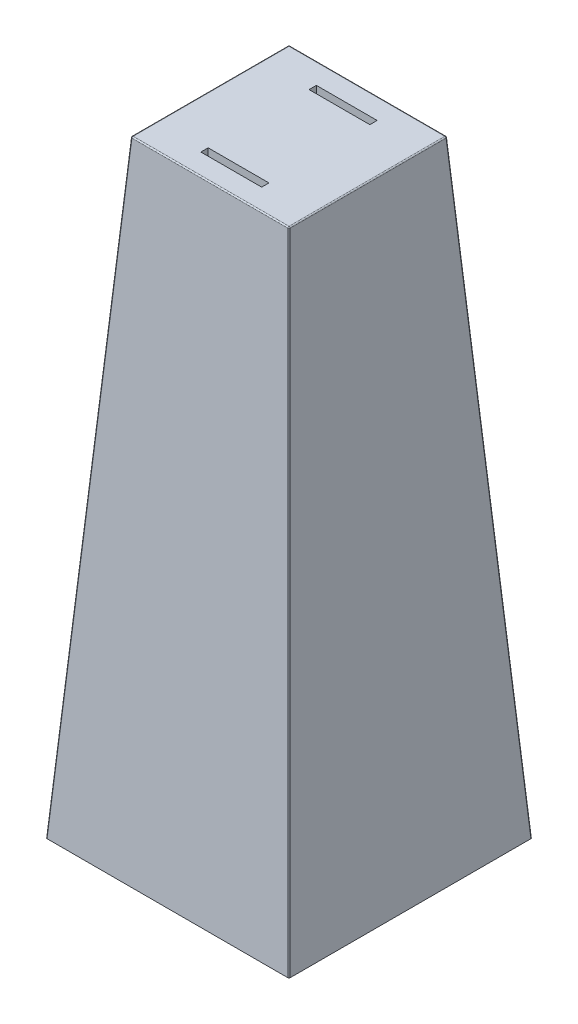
ISO-10303-21;
HEADER;
FILE_DESCRIPTION(('STEP AP214'),'2;1');
FILE_NAME('part.step','',(''),(''),'','','');
FILE_SCHEMA(('AUTOMOTIVE_DESIGN { 1 0 10303 214 1 1 1 1 }'));
ENDSEC;
DATA;
#1=APPLICATION_CONTEXT('core data for automotive mechanical design processes');
#2=APPLICATION_PROTOCOL_DEFINITION('international standard','automotive_design',2000,#1);
#3=PRODUCT_CONTEXT('',#1,'mechanical');
#4=PRODUCT('Part','Part','',(#3));
#5=PRODUCT_RELATED_PRODUCT_CATEGORY('part','',(#4));
#6=PRODUCT_DEFINITION_FORMATION('','',#4);
#7=PRODUCT_DEFINITION_CONTEXT('part definition',#1,'design');
#8=PRODUCT_DEFINITION('design','',#6,#7);
#9=PRODUCT_DEFINITION_SHAPE('','',#8);
#10=(LENGTH_UNIT() NAMED_UNIT(*) SI_UNIT(.MILLI.,.METRE.));
#11=(NAMED_UNIT(*) PLANE_ANGLE_UNIT() SI_UNIT($,.RADIAN.));
#12=(NAMED_UNIT(*) SI_UNIT($,.STERADIAN.) SOLID_ANGLE_UNIT());
#13=UNCERTAINTY_MEASURE_WITH_UNIT(LENGTH_MEASURE(1.E-05),#10,'distance_accuracy_value','');
#14=(GEOMETRIC_REPRESENTATION_CONTEXT(3) GLOBAL_UNCERTAINTY_ASSIGNED_CONTEXT((#13)) GLOBAL_UNIT_ASSIGNED_CONTEXT((#10,
#11,#12)) REPRESENTATION_CONTEXT('',''));
#15=CARTESIAN_POINT('',(0.,0.,0.));
#16=DIRECTION('',(0.,0.,1.));
#17=DIRECTION('',(1.,0.,0.));
#18=AXIS2_PLACEMENT_3D('',#15,#16,#17);
#19=CARTESIAN_POINT('',(65.,0.,-65.));
#20=DIRECTION('',(0.,1.,0.));
#21=DIRECTION('',(0.,0.,1.));
#22=AXIS2_PLACEMENT_3D('',#19,#20,#21);
#23=PLANE('',#22);
#24=DIRECTION('',(0.,0.,-1.));
#25=VECTOR('',#24,1.);
#26=CARTESIAN_POINT('',(-25.,0.,-47.5));
#27=LINE('',#26,#25);
#28=CARTESIAN_POINT('',(-25.,0.,-41.5));
#29=VERTEX_POINT('',#28);
#30=CARTESIAN_POINT('',(-25.,0.,-47.5));
#31=VERTEX_POINT('',#30);
#32=EDGE_CURVE('E195',#29,#31,#27,.T.);
#33=ORIENTED_EDGE('',*,*,#32,.T.);
#34=DIRECTION('',(1.,0.,0.));
#35=VECTOR('',#34,1.);
#36=CARTESIAN_POINT('',(-25.,0.,-47.5));
#37=LINE('',#36,#35);
#38=CARTESIAN_POINT('',(25.,0.,-47.5));
#39=VERTEX_POINT('',#38);
#40=EDGE_CURVE('E49',#31,#39,#37,.T.);
#41=ORIENTED_EDGE('',*,*,#40,.T.);
#42=DIRECTION('',(0.,0.,1.));
#43=VECTOR('',#42,1.);
#44=CARTESIAN_POINT('',(25.,0.,-47.5));
#45=LINE('',#44,#43);
#46=CARTESIAN_POINT('',(25.,0.,-41.5));
#47=VERTEX_POINT('',#46);
#48=EDGE_CURVE('E189',#39,#47,#45,.T.);
#49=ORIENTED_EDGE('',*,*,#48,.T.);
#50=DIRECTION('',(-1.,0.,0.));
#51=VECTOR('',#50,1.);
#52=CARTESIAN_POINT('',(-25.,0.,-41.5));
#53=LINE('',#52,#51);
#54=EDGE_CURVE('E192',#47,#29,#53,.T.);
#55=ORIENTED_EDGE('',*,*,#54,.T.);
#56=EDGE_LOOP('',(#33,#41,#49,#55));
#57=FACE_BOUND('',#56,.T.);
#58=DIRECTION('',(0.,0.,1.));
#59=VECTOR('',#58,1.);
#60=CARTESIAN_POINT('',(-64.0674849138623,0.,65.0000000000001));
#61=LINE('',#60,#59);
#62=CARTESIAN_POINT('',(-64.0674849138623,0.,-64.0674849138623));
#63=VERTEX_POINT('',#62);
#64=CARTESIAN_POINT('',(-64.0674849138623,0.,64.0674849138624));
#65=VERTEX_POINT('',#64);
#66=EDGE_CURVE('E268',#63,#65,#61,.T.);
#67=ORIENTED_EDGE('',*,*,#66,.T.);
#68=DIRECTION('',(1.,0.,0.));
#69=VECTOR('',#68,1.);
#70=CARTESIAN_POINT('',(65.,0.,64.0674849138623));
#71=LINE('',#70,#69);
#72=CARTESIAN_POINT('',(64.0674849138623,0.,64.0674849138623));
#73=VERTEX_POINT('',#72);
#74=EDGE_CURVE('E274',#65,#73,#71,.T.);
#75=ORIENTED_EDGE('',*,*,#74,.T.);
#76=DIRECTION('',(0.,0.,-1.));
#77=VECTOR('',#76,1.);
#78=CARTESIAN_POINT('',(64.0674849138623,0.,-65.));
#79=LINE('',#78,#77);
#80=CARTESIAN_POINT('',(64.0674849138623,0.,-64.0674849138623));
#81=VERTEX_POINT('',#80);
#82=EDGE_CURVE('E272',#73,#81,#79,.T.);
#83=ORIENTED_EDGE('',*,*,#82,.T.);
#84=DIRECTION('',(-1.,0.,0.));
#85=VECTOR('',#84,1.);
#86=CARTESIAN_POINT('',(-65.,0.,-64.0674849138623));
#87=LINE('',#86,#85);
#88=EDGE_CURVE('E270',#81,#63,#87,.T.);
#89=ORIENTED_EDGE('',*,*,#88,.T.);
#90=EDGE_LOOP('',(#67,#75,#83,#89));
#91=FACE_BOUND('',#90,.T.);
#92=DIRECTION('',(-1.,0.,0.));
#93=VECTOR('',#92,1.);
#94=CARTESIAN_POINT('',(-25.,0.,47.5));
#95=LINE('',#94,#93);
#96=CARTESIAN_POINT('',(25.,0.,47.5));
#97=VERTEX_POINT('',#96);
#98=CARTESIAN_POINT('',(-25.,0.,47.5));
#99=VERTEX_POINT('',#98);
#100=EDGE_CURVE('E171',#97,#99,#95,.T.);
#101=ORIENTED_EDGE('',*,*,#100,.T.);
#102=DIRECTION('',(0.,0.,-1.));
#103=VECTOR('',#102,1.);
#104=CARTESIAN_POINT('',(-25.,0.,41.5));
#105=LINE('',#104,#103);
#106=CARTESIAN_POINT('',(-25.,0.,41.5));
#107=VERTEX_POINT('',#106);
#108=EDGE_CURVE('E41',#99,#107,#105,.T.);
#109=ORIENTED_EDGE('',*,*,#108,.T.);
#110=DIRECTION('',(1.,0.,0.));
#111=VECTOR('',#110,1.);
#112=CARTESIAN_POINT('',(-25.,0.,41.5));
#113=LINE('',#112,#111);
#114=CARTESIAN_POINT('',(25.,0.,41.5));
#115=VERTEX_POINT('',#114);
#116=EDGE_CURVE('E154',#107,#115,#113,.T.);
#117=ORIENTED_EDGE('',*,*,#116,.T.);
#118=DIRECTION('',(0.,0.,1.));
#119=VECTOR('',#118,1.);
#120=CARTESIAN_POINT('',(25.,0.,41.5));
#121=LINE('',#120,#119);
#122=EDGE_CURVE('E162',#115,#97,#121,.T.);
#123=ORIENTED_EDGE('',*,*,#122,.T.);
#124=EDGE_LOOP('',(#101,#109,#117,#123));
#125=FACE_BOUND('',#124,.T.);
#126=ADVANCED_FACE('F26',(#57,#91,#125),#23,.T.);
#127=CARTESIAN_POINT('',(65.,0.,64.9999999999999));
#128=DIRECTION('',(0.997564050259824,0.0697564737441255,0.));
#129=DIRECTION('',(-0.0697564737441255,0.997564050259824,0.));
#130=AXIS2_PLACEMENT_3D('',#127,#128,#129);
#131=PLANE('',#130);
#132=DIRECTION('',(0.,0.,1.));
#133=VECTOR('',#132,1.);
#134=CARTESIAN_POINT('',(65.0650489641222,-0.930243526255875,64.9999999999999));
#135=LINE('',#134,#133);
#136=CARTESIAN_POINT('',(65.0650489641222,-0.930243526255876,-64.0674849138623));
#137=VERTEX_POINT('',#136);
#138=CARTESIAN_POINT('',(65.0650489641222,-0.930243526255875,64.0674849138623));
#139=VERTEX_POINT('',#138);
#140=EDGE_CURVE('E279',#137,#139,#135,.T.);
#141=ORIENTED_EDGE('',*,*,#140,.T.);
#142=DIRECTION('',(0.0695873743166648,-0.995145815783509,0.0695873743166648));
#143=VECTOR('',#142,1.);
#144=CARTESIAN_POINT('',(65.0048306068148,-0.0690808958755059,64.0072665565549));
#145=LINE('',#144,#143);
#146=CARTESIAN_POINT('',(99.9634059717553,-500.,98.9658419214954));
#147=VERTEX_POINT('',#146);
#148=EDGE_CURVE('E281',#139,#147,#145,.T.);
#149=ORIENTED_EDGE('',*,*,#148,.T.);
#150=DIRECTION('',(0.,0.,-1.));
#151=VECTOR('',#150,1.);
#152=CARTESIAN_POINT('',(99.9634059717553,-500.,-65.));
#153=LINE('',#152,#151);
#154=CARTESIAN_POINT('',(99.9634059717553,-500.,-98.9658419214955));
#155=VERTEX_POINT('',#154);
#156=EDGE_CURVE('E249',#155,#147,#153,.F.);
#157=ORIENTED_EDGE('',*,*,#156,.F.);
#158=DIRECTION('',(0.0695873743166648,-0.995145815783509,-0.0695873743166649));
#159=VECTOR('',#158,1.);
#160=CARTESIAN_POINT('',(64.3753182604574,8.93336507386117,-63.3777542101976));
#161=LINE('',#160,#159);
#162=EDGE_CURVE('E277',#155,#137,#161,.F.);
#163=ORIENTED_EDGE('',*,*,#162,.T.);
#164=EDGE_LOOP('',(#141,#149,#157,#163));
#165=FACE_BOUND('',#164,.T.);
#166=ADVANCED_FACE('F308',(#165),#131,.T.);
#167=CARTESIAN_POINT('',(65.,0.,64.9999999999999));
#168=DIRECTION('',(0.,0.0697564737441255,0.997564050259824));
#169=DIRECTION('',(0.,-0.997564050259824,0.0697564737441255));
#170=AXIS2_PLACEMENT_3D('',#167,#168,#169);
#171=PLANE('',#170);
#172=DIRECTION('',(1.,0.,0.));
#173=VECTOR('',#172,1.);
#174=CARTESIAN_POINT('',(65.0000000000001,-500.,99.9634059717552));
#175=LINE('',#174,#173);
#176=CARTESIAN_POINT('',(98.9658419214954,-500.,99.9634059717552));
#177=VERTEX_POINT('',#176);
#178=CARTESIAN_POINT('',(-98.9658419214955,-500.,99.9634059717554));
#179=VERTEX_POINT('',#178);
#180=EDGE_CURVE('E252',#177,#179,#175,.F.);
#181=ORIENTED_EDGE('',*,*,#180,.F.);
#182=DIRECTION('',(0.0695873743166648,-0.995145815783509,0.0695873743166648));
#183=VECTOR('',#182,1.);
#184=CARTESIAN_POINT('',(64.0072665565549,-0.0690808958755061,65.0048306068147));
#185=LINE('',#184,#183);
#186=CARTESIAN_POINT('',(64.0674849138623,-0.930243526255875,65.0650489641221));
#187=VERTEX_POINT('',#186);
#188=EDGE_CURVE('E266',#177,#187,#185,.F.);
#189=ORIENTED_EDGE('',*,*,#188,.T.);
#190=DIRECTION('',(-1.,0.,0.));
#191=VECTOR('',#190,1.);
#192=CARTESIAN_POINT('',(-65.,-0.930243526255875,65.0650489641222));
#193=LINE('',#192,#191);
#194=CARTESIAN_POINT('',(-64.0674849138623,-0.930243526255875,65.0650489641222));
#195=VERTEX_POINT('',#194);
#196=EDGE_CURVE('E263',#187,#195,#193,.T.);
#197=ORIENTED_EDGE('',*,*,#196,.T.);
#198=DIRECTION('',(-0.0695873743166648,-0.995145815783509,0.0695873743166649));
#199=VECTOR('',#198,1.);
#200=CARTESIAN_POINT('',(-63.3777542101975,8.93336507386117,64.3753182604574));
#201=LINE('',#200,#199);
#202=EDGE_CURVE('E261',#195,#179,#201,.T.);
#203=ORIENTED_EDGE('',*,*,#202,.T.);
#204=EDGE_LOOP('',(#181,#189,#197,#203));
#205=FACE_BOUND('',#204,.T.);
#206=ADVANCED_FACE('F28',(#205),#171,.T.);
#207=CARTESIAN_POINT('',(-65.,0.,65.0000000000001));
#208=DIRECTION('',(-0.997564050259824,0.0697564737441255,0.));
#209=DIRECTION('',(-0.0697564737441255,-0.997564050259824,0.));
#210=AXIS2_PLACEMENT_3D('',#207,#208,#209);
#211=PLANE('',#210);
#212=DIRECTION('',(0.,0.,-1.));
#213=VECTOR('',#212,1.);
#214=CARTESIAN_POINT('',(-65.0650489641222,-0.930243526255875,-64.9999999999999));
#215=LINE('',#214,#213);
#216=CARTESIAN_POINT('',(-65.0650489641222,-0.930243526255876,64.0674849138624));
#217=VERTEX_POINT('',#216);
#218=CARTESIAN_POINT('',(-65.0650489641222,-0.930243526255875,-64.0674849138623));
#219=VERTEX_POINT('',#218);
#220=EDGE_CURVE('E291',#217,#219,#215,.T.);
#221=ORIENTED_EDGE('',*,*,#220,.T.);
#222=DIRECTION('',(-0.0695873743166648,-0.995145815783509,-0.0695873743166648));
#223=VECTOR('',#222,1.);
#224=CARTESIAN_POINT('',(-64.3753182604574,8.93336507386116,-63.3777542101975));
#225=LINE('',#224,#223);
#226=CARTESIAN_POINT('',(-99.9634059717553,-500.,-98.9658419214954));
#227=VERTEX_POINT('',#226);
#228=EDGE_CURVE('E293',#219,#227,#225,.T.);
#229=ORIENTED_EDGE('',*,*,#228,.T.);
#230=DIRECTION('',(0.,0.,1.));
#231=VECTOR('',#230,1.);
#232=CARTESIAN_POINT('',(-99.9634059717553,-500.,-65.));
#233=LINE('',#232,#231);
#234=CARTESIAN_POINT('',(-99.9634059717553,-500.,98.9658419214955));
#235=VERTEX_POINT('',#234);
#236=EDGE_CURVE('E255',#235,#227,#233,.F.);
#237=ORIENTED_EDGE('',*,*,#236,.F.);
#238=DIRECTION('',(-0.0695873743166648,-0.995145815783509,0.0695873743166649));
#239=VECTOR('',#238,1.);
#240=CARTESIAN_POINT('',(-65.0048306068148,-0.0690808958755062,64.007266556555));
#241=LINE('',#240,#239);
#242=EDGE_CURVE('E289',#235,#217,#241,.F.);
#243=ORIENTED_EDGE('',*,*,#242,.T.);
#244=EDGE_LOOP('',(#221,#229,#237,#243));
#245=FACE_BOUND('',#244,.T.);
#246=ADVANCED_FACE('F338',(#245),#211,.T.);
#247=CARTESIAN_POINT('',(65.,0.,-65.));
#248=DIRECTION('',(0.,0.0697564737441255,-0.997564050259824));
#249=DIRECTION('',(0.,0.997564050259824,0.0697564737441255));
#250=AXIS2_PLACEMENT_3D('',#247,#248,#249);
#251=PLANE('',#250);
#252=DIRECTION('',(1.,0.,0.));
#253=VECTOR('',#252,1.);
#254=CARTESIAN_POINT('',(65.,-0.930243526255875,-65.0650489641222));
#255=LINE('',#254,#253);
#256=CARTESIAN_POINT('',(-64.0674849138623,-0.930243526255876,-65.0650489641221));
#257=VERTEX_POINT('',#256);
#258=CARTESIAN_POINT('',(64.0674849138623,-0.930243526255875,-65.0650489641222));
#259=VERTEX_POINT('',#258);
#260=EDGE_CURVE('E285',#257,#259,#255,.T.);
#261=ORIENTED_EDGE('',*,*,#260,.T.);
#262=DIRECTION('',(0.0695873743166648,-0.995145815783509,-0.0695873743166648));
#263=VECTOR('',#262,1.);
#264=CARTESIAN_POINT('',(64.007266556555,-0.0690808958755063,-65.0048306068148));
#265=LINE('',#264,#263);
#266=CARTESIAN_POINT('',(98.9658419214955,-500.,-99.9634059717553));
#267=VERTEX_POINT('',#266);
#268=EDGE_CURVE('E287',#259,#267,#265,.T.);
#269=ORIENTED_EDGE('',*,*,#268,.T.);
#270=DIRECTION('',(-1.,0.,0.));
#271=VECTOR('',#270,1.);
#272=CARTESIAN_POINT('',(65.,-500.,-99.9634059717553));
#273=LINE('',#272,#271);
#274=CARTESIAN_POINT('',(-98.9658419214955,-500.,-99.9634059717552));
#275=VERTEX_POINT('',#274);
#276=EDGE_CURVE('E258',#275,#267,#273,.F.);
#277=ORIENTED_EDGE('',*,*,#276,.F.);
#278=DIRECTION('',(-0.0695873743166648,-0.995145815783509,-0.0695873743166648));
#279=VECTOR('',#278,1.);
#280=CARTESIAN_POINT('',(-63.3777542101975,8.93336507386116,-64.3753182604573));
#281=LINE('',#280,#279);
#282=EDGE_CURVE('E283',#275,#257,#281,.F.);
#283=ORIENTED_EDGE('',*,*,#282,.T.);
#284=EDGE_LOOP('',(#261,#269,#277,#283));
#285=FACE_BOUND('',#284,.T.);
#286=ADVANCED_FACE('F360',(#285),#251,.T.);
#287=CARTESIAN_POINT('',(65.,-500.,-65.));
#288=DIRECTION('',(0.,1.,0.));
#289=DIRECTION('',(0.,0.,1.));
#290=AXIS2_PLACEMENT_3D('',#287,#288,#289);
#291=PLANE('',#290);
#292=ORIENTED_EDGE('',*,*,#156,.T.);
#293=CARTESIAN_POINT('',(98.9609640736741,-500.,98.960964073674));
#294=DIRECTION('',(0.,1.,0.));
#295=DIRECTION('',(-0.707106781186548,0.,-0.707106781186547));
#296=AXIS2_PLACEMENT_3D('',#293,#294,#295);
#297=ELLIPSE('',#296,1.00487786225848,1.);
#298=EDGE_CURVE('E11',#147,#177,#297,.F.);
#299=ORIENTED_EDGE('',*,*,#298,.T.);
#300=ORIENTED_EDGE('',*,*,#180,.T.);
#301=CARTESIAN_POINT('',(-98.9609640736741,-500.,98.9609640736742));
#302=DIRECTION('',(0.,1.,0.));
#303=DIRECTION('',(0.707106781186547,0.,-0.707106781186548));
#304=AXIS2_PLACEMENT_3D('',#301,#302,#303);
#305=ELLIPSE('',#304,1.00487786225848,1.);
#306=EDGE_CURVE('E295',#179,#235,#305,.F.);
#307=ORIENTED_EDGE('',*,*,#306,.T.);
#308=ORIENTED_EDGE('',*,*,#236,.T.);
#309=CARTESIAN_POINT('',(-98.9609640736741,-500.,-98.960964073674));
#310=DIRECTION('',(0.,1.,0.));
#311=DIRECTION('',(0.707106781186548,0.,0.707106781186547));
#312=AXIS2_PLACEMENT_3D('',#309,#310,#311);
#313=ELLIPSE('',#312,1.00487786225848,1.);
#314=EDGE_CURVE('E297',#227,#275,#313,.F.);
#315=ORIENTED_EDGE('',*,*,#314,.T.);
#316=ORIENTED_EDGE('',*,*,#276,.T.);
#317=CARTESIAN_POINT('',(98.9609640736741,-500.,-98.9609640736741));
#318=DIRECTION('',(0.,1.,0.));
#319=DIRECTION('',(-0.707106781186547,0.,0.707106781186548));
#320=AXIS2_PLACEMENT_3D('',#317,#318,#319);
#321=ELLIPSE('',#320,1.00487786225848,1.);
#322=EDGE_CURVE('E34',#267,#155,#321,.F.);
#323=ORIENTED_EDGE('',*,*,#322,.T.);
#324=EDGE_LOOP('',(#292,#299,#300,#307,#308,#315,#316,#323));
#325=FACE_BOUND('',#324,.T.);
#326=ADVANCED_FACE('F301',(#325),#291,.F.);
#327=CARTESIAN_POINT('',(63.3777542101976,8.86360860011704,-63.3777542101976));
#328=DIRECTION('',(-0.0695873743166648,0.995145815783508,0.0695873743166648));
#329=DIRECTION('',(0.,-0.0697564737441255,0.997564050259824));
#330=AXIS2_PLACEMENT_3D('',#327,#328,#329);
#331=CYLINDRICAL_SURFACE('',#330,1.);
#332=ORIENTED_EDGE('',*,*,#322,.F.);
#333=ORIENTED_EDGE('',*,*,#268,.F.);
#334=CARTESIAN_POINT('',(64.0674849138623,-1.,-64.0674849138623));
#335=DIRECTION('',(-0.0695873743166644,0.995145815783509,0.0695873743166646));
#336=DIRECTION('',(0.,-0.0697564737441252,0.997564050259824));
#337=AXIS2_PLACEMENT_3D('',#334,#335,#336);
#338=CIRCLE('',#337,1.);
#339=EDGE_CURVE('E243',#137,#259,#338,.T.);
#340=ORIENTED_EDGE('',*,*,#339,.F.);
#341=ORIENTED_EDGE('',*,*,#162,.F.);
#342=EDGE_LOOP('',(#332,#333,#340,#341));
#343=FACE_BOUND('',#342,.T.);
#344=ADVANCED_FACE('F311',(#343),#331,.T.);
#345=CARTESIAN_POINT('',(-63.3777542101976,8.86360860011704,-63.3777542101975));
#346=DIRECTION('',(0.0695873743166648,0.995145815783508,0.0695873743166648));
#347=DIRECTION('',(-0.997564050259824,0.0697564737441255,0.));
#348=AXIS2_PLACEMENT_3D('',#345,#346,#347);
#349=CYLINDRICAL_SURFACE('',#348,1.);
#350=ORIENTED_EDGE('',*,*,#314,.F.);
#351=ORIENTED_EDGE('',*,*,#228,.F.);
#352=CARTESIAN_POINT('',(-64.0674849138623,-1.,-64.0674849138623));
#353=DIRECTION('',(0.0695873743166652,0.995145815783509,0.0695873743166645));
#354=DIRECTION('',(-0.997564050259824,0.0697564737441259,0.));
#355=AXIS2_PLACEMENT_3D('',#352,#353,#354);
#356=CIRCLE('',#355,1.);
#357=EDGE_CURVE('E240',#257,#219,#356,.T.);
#358=ORIENTED_EDGE('',*,*,#357,.F.);
#359=ORIENTED_EDGE('',*,*,#282,.F.);
#360=EDGE_LOOP('',(#350,#351,#358,#359));
#361=FACE_BOUND('',#360,.T.);
#362=ADVANCED_FACE('F343',(#361),#349,.T.);
#363=CARTESIAN_POINT('',(65.,-1.,-64.0674849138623));
#364=DIRECTION('',(1.,0.,0.));
#365=DIRECTION('',(0.,0.,-1.));
#366=AXIS2_PLACEMENT_3D('',#363,#364,#365);
#367=CYLINDRICAL_SURFACE('',#366,1.);
#368=CARTESIAN_POINT('',(64.0674849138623,-1.,-64.0674849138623));
#369=DIRECTION('',(1.,0.,0.));
#370=DIRECTION('',(0.,0.,-1.));
#371=AXIS2_PLACEMENT_3D('',#368,#369,#370);
#372=CIRCLE('',#371,1.);
#373=EDGE_CURVE('E246',#259,#81,#372,.T.);
#374=ORIENTED_EDGE('',*,*,#373,.F.);
#375=ORIENTED_EDGE('',*,*,#260,.F.);
#376=CARTESIAN_POINT('',(-64.0674849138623,-1.,-64.0674849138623));
#377=DIRECTION('',(-1.,0.,0.));
#378=DIRECTION('',(0.,0.,1.));
#379=AXIS2_PLACEMENT_3D('',#376,#377,#378);
#380=CIRCLE('',#379,1.);
#381=EDGE_CURVE('E237',#63,#257,#380,.T.);
#382=ORIENTED_EDGE('',*,*,#381,.F.);
#383=ORIENTED_EDGE('',*,*,#88,.F.);
#384=EDGE_LOOP('',(#374,#375,#382,#383));
#385=FACE_BOUND('',#384,.T.);
#386=ADVANCED_FACE('F358',(#385),#367,.T.);
#387=CARTESIAN_POINT('',(64.0674849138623,-1.,-64.0674849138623));
#388=DIRECTION('',(0.,0.,1.));
#389=DIRECTION('',(1.,0.,0.));
#390=AXIS2_PLACEMENT_3D('',#387,#388,#389);
#391=SPHERICAL_SURFACE('',#390,1.);
#392=ORIENTED_EDGE('',*,*,#339,.T.);
#393=ORIENTED_EDGE('',*,*,#373,.T.);
#394=CARTESIAN_POINT('',(64.0674849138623,-1.,-64.0674849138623));
#395=DIRECTION('',(0.,0.,-1.));
#396=DIRECTION('',(-1.,0.,0.));
#397=AXIS2_PLACEMENT_3D('',#394,#395,#396);
#398=CIRCLE('',#397,1.);
#399=EDGE_CURVE('E234',#137,#81,#398,.F.);
#400=ORIENTED_EDGE('',*,*,#399,.F.);
#401=EDGE_LOOP('',(#392,#393,#400));
#402=FACE_BOUND('',#401,.T.);
#403=ADVANCED_FACE('F316',(#402),#391,.T.);
#404=CARTESIAN_POINT('',(-64.0674849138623,-1.,-64.0674849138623));
#405=DIRECTION('',(0.,0.,1.));
#406=DIRECTION('',(1.,0.,0.));
#407=AXIS2_PLACEMENT_3D('',#404,#405,#406);
#408=SPHERICAL_SURFACE('',#407,1.);
#409=ORIENTED_EDGE('',*,*,#381,.T.);
#410=ORIENTED_EDGE('',*,*,#357,.T.);
#411=CARTESIAN_POINT('',(-64.0674849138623,-1.,-64.0674849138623));
#412=DIRECTION('',(0.,0.,-1.));
#413=DIRECTION('',(-1.,0.,0.));
#414=AXIS2_PLACEMENT_3D('',#411,#412,#413);
#415=CIRCLE('',#414,1.);
#416=EDGE_CURVE('E231',#63,#219,#415,.F.);
#417=ORIENTED_EDGE('',*,*,#416,.F.);
#418=EDGE_LOOP('',(#409,#410,#417));
#419=FACE_BOUND('',#418,.T.);
#420=ADVANCED_FACE('F347',(#419),#408,.T.);
#421=CARTESIAN_POINT('',(64.0674849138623,-1.,64.9999999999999));
#422=DIRECTION('',(0.,0.,1.));
#423=DIRECTION('',(1.,0.,0.));
#424=AXIS2_PLACEMENT_3D('',#421,#422,#423);
#425=CYLINDRICAL_SURFACE('',#424,1.);
#426=ORIENTED_EDGE('',*,*,#399,.T.);
#427=ORIENTED_EDGE('',*,*,#82,.F.);
#428=CARTESIAN_POINT('',(64.0674849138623,-1.,64.0674849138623));
#429=DIRECTION('',(0.,0.,1.));
#430=DIRECTION('',(1.,0.,0.));
#431=AXIS2_PLACEMENT_3D('',#428,#429,#430);
#432=CIRCLE('',#431,1.);
#433=EDGE_CURVE('E228',#139,#73,#432,.T.);
#434=ORIENTED_EDGE('',*,*,#433,.F.);
#435=ORIENTED_EDGE('',*,*,#140,.F.);
#436=EDGE_LOOP('',(#426,#427,#434,#435));
#437=FACE_BOUND('',#436,.T.);
#438=ADVANCED_FACE('F320',(#437),#425,.T.);
#439=CARTESIAN_POINT('',(64.0072665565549,-0.138837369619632,64.0072665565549));
#440=DIRECTION('',(-0.0695873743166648,0.995145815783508,-0.0695873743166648));
#441=DIRECTION('',(-0.997564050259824,-0.0697564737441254,0.));
#442=AXIS2_PLACEMENT_3D('',#439,#440,#441);
#443=CYLINDRICAL_SURFACE('',#442,1.);
#444=ORIENTED_EDGE('',*,*,#298,.F.);
#445=ORIENTED_EDGE('',*,*,#148,.F.);
#446=CARTESIAN_POINT('',(64.0674849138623,-1.,64.0674849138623));
#447=DIRECTION('',(-0.0695873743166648,0.995145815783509,-0.0695873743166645));
#448=DIRECTION('',(-0.997564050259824,-0.0697564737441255,0.));
#449=AXIS2_PLACEMENT_3D('',#446,#447,#448);
#450=CIRCLE('',#449,1.);
#451=EDGE_CURVE('E225',#187,#139,#450,.T.);
#452=ORIENTED_EDGE('',*,*,#451,.F.);
#453=ORIENTED_EDGE('',*,*,#188,.F.);
#454=EDGE_LOOP('',(#444,#445,#452,#453));
#455=FACE_BOUND('',#454,.T.);
#456=ADVANCED_FACE('F323',(#455),#443,.T.);
#457=CARTESIAN_POINT('',(-64.007266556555,-0.138837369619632,64.007266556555));
#458=DIRECTION('',(0.0695873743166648,0.995145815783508,-0.0695873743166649));
#459=DIRECTION('',(0.,0.0697564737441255,0.997564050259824));
#460=AXIS2_PLACEMENT_3D('',#457,#458,#459);
#461=CYLINDRICAL_SURFACE('',#460,1.);
#462=ORIENTED_EDGE('',*,*,#306,.F.);
#463=ORIENTED_EDGE('',*,*,#202,.F.);
#464=CARTESIAN_POINT('',(-64.0674849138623,-1.,64.0674849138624));
#465=DIRECTION('',(0.0695873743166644,0.995145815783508,-0.0695873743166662));
#466=DIRECTION('',(0.,0.0697564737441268,0.997564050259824));
#467=AXIS2_PLACEMENT_3D('',#464,#465,#466);
#468=CIRCLE('',#467,1.);
#469=EDGE_CURVE('E222',#217,#195,#468,.T.);
#470=ORIENTED_EDGE('',*,*,#469,.F.);
#471=ORIENTED_EDGE('',*,*,#242,.F.);
#472=EDGE_LOOP('',(#462,#463,#470,#471));
#473=FACE_BOUND('',#472,.T.);
#474=ADVANCED_FACE('F333',(#473),#461,.T.);
#475=CARTESIAN_POINT('',(-64.0674849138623,-1.,65.0000000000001));
#476=DIRECTION('',(0.,0.,-1.));
#477=DIRECTION('',(-1.,0.,0.));
#478=AXIS2_PLACEMENT_3D('',#475,#476,#477);
#479=CYLINDRICAL_SURFACE('',#478,1.);
#480=ORIENTED_EDGE('',*,*,#416,.T.);
#481=ORIENTED_EDGE('',*,*,#220,.F.);
#482=CARTESIAN_POINT('',(-64.0674849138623,-1.,64.0674849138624));
#483=DIRECTION('',(0.,0.,1.));
#484=DIRECTION('',(1.,0.,0.));
#485=AXIS2_PLACEMENT_3D('',#482,#483,#484);
#486=CIRCLE('',#485,1.);
#487=EDGE_CURVE('E219',#65,#217,#486,.T.);
#488=ORIENTED_EDGE('',*,*,#487,.F.);
#489=ORIENTED_EDGE('',*,*,#66,.F.);
#490=EDGE_LOOP('',(#480,#481,#488,#489));
#491=FACE_BOUND('',#490,.T.);
#492=ADVANCED_FACE('F351',(#491),#479,.T.);
#493=CARTESIAN_POINT('',(64.0674849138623,-1.,64.0674849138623));
#494=DIRECTION('',(0.,0.,1.));
#495=DIRECTION('',(1.,0.,0.));
#496=AXIS2_PLACEMENT_3D('',#493,#494,#495);
#497=SPHERICAL_SURFACE('',#496,1.);
#498=ORIENTED_EDGE('',*,*,#451,.T.);
#499=ORIENTED_EDGE('',*,*,#433,.T.);
#500=CARTESIAN_POINT('',(64.0674849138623,-1.,64.0674849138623));
#501=DIRECTION('',(1.,0.,0.));
#502=DIRECTION('',(0.,0.,-1.));
#503=AXIS2_PLACEMENT_3D('',#500,#501,#502);
#504=CIRCLE('',#503,1.);
#505=EDGE_CURVE('E217',#187,#73,#504,.F.);
#506=ORIENTED_EDGE('',*,*,#505,.F.);
#507=EDGE_LOOP('',(#498,#499,#506));
#508=FACE_BOUND('',#507,.T.);
#509=ADVANCED_FACE('F396',(#508),#497,.T.);
#510=CARTESIAN_POINT('',(-64.0674849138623,-1.,64.0674849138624));
#511=DIRECTION('',(0.,0.,1.));
#512=DIRECTION('',(1.,0.,0.));
#513=AXIS2_PLACEMENT_3D('',#510,#511,#512);
#514=SPHERICAL_SURFACE('',#513,1.);
#515=ORIENTED_EDGE('',*,*,#487,.T.);
#516=ORIENTED_EDGE('',*,*,#469,.T.);
#517=CARTESIAN_POINT('',(-64.0674849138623,-1.,64.0674849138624));
#518=DIRECTION('',(-1.,0.,0.));
#519=DIRECTION('',(0.,0.,1.));
#520=AXIS2_PLACEMENT_3D('',#517,#518,#519);
#521=CIRCLE('',#520,1.);
#522=EDGE_CURVE('E215',#65,#195,#521,.F.);
#523=ORIENTED_EDGE('',*,*,#522,.F.);
#524=EDGE_LOOP('',(#515,#516,#523));
#525=FACE_BOUND('',#524,.T.);
#526=ADVANCED_FACE('F399',(#525),#514,.T.);
#527=CARTESIAN_POINT('',(65.,-1.,64.0674849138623));
#528=DIRECTION('',(-1.,0.,0.));
#529=DIRECTION('',(0.,0.,1.));
#530=AXIS2_PLACEMENT_3D('',#527,#528,#529);
#531=CYLINDRICAL_SURFACE('',#530,1.);
#532=ORIENTED_EDGE('',*,*,#505,.T.);
#533=ORIENTED_EDGE('',*,*,#74,.F.);
#534=ORIENTED_EDGE('',*,*,#522,.T.);
#535=ORIENTED_EDGE('',*,*,#196,.F.);
#536=EDGE_LOOP('',(#532,#533,#534,#535));
#537=FACE_BOUND('',#536,.T.);
#538=ADVANCED_FACE('F403',(#537),#531,.T.);
#539=CARTESIAN_POINT('',(-25.,-200.,-47.5));
#540=DIRECTION('',(0.,0.,1.));
#541=DIRECTION('',(1.,0.,0.));
#542=AXIS2_PLACEMENT_3D('',#539,#540,#541);
#543=PLANE('',#542);
#544=ORIENTED_EDGE('',*,*,#40,.F.);
#545=DIRECTION('',(0.,1.,0.));
#546=VECTOR('',#545,1.);
#547=CARTESIAN_POINT('',(-25.,-200.,-47.5));
#548=LINE('',#547,#546);
#549=CARTESIAN_POINT('',(-25.,-200.,-47.5));
#550=VERTEX_POINT('',#549);
#551=EDGE_CURVE('E207',#550,#31,#548,.T.);
#552=ORIENTED_EDGE('',*,*,#551,.F.);
#553=DIRECTION('',(1.,0.,0.));
#554=VECTOR('',#553,1.);
#555=CARTESIAN_POINT('',(-25.,-200.,-47.5));
#556=LINE('',#555,#554);
#557=CARTESIAN_POINT('',(25.,-200.,-47.5));
#558=VERTEX_POINT('',#557);
#559=EDGE_CURVE('E198',#550,#558,#556,.T.);
#560=ORIENTED_EDGE('',*,*,#559,.T.);
#561=DIRECTION('',(0.,1.,0.));
#562=VECTOR('',#561,1.);
#563=CARTESIAN_POINT('',(25.,-200.,-47.5));
#564=LINE('',#563,#562);
#565=EDGE_CURVE('E213',#558,#39,#564,.T.);
#566=ORIENTED_EDGE('',*,*,#565,.T.);
#567=EDGE_LOOP('',(#544,#552,#560,#566));
#568=FACE_BOUND('',#567,.T.);
#569=ADVANCED_FACE('F406',(#568),#543,.T.);
#570=CARTESIAN_POINT('',(25.,-200.,-47.5));
#571=DIRECTION('',(-1.,0.,0.));
#572=DIRECTION('',(0.,0.,1.));
#573=AXIS2_PLACEMENT_3D('',#570,#571,#572);
#574=PLANE('',#573);
#575=ORIENTED_EDGE('',*,*,#48,.F.);
#576=ORIENTED_EDGE('',*,*,#565,.F.);
#577=DIRECTION('',(0.,0.,1.));
#578=VECTOR('',#577,1.);
#579=CARTESIAN_POINT('',(25.,-200.,-47.5));
#580=LINE('',#579,#578);
#581=CARTESIAN_POINT('',(25.,-200.,-41.5));
#582=VERTEX_POINT('',#581);
#583=EDGE_CURVE('E201',#558,#582,#580,.T.);
#584=ORIENTED_EDGE('',*,*,#583,.T.);
#585=DIRECTION('',(0.,1.,0.));
#586=VECTOR('',#585,1.);
#587=CARTESIAN_POINT('',(25.,-200.,-41.5));
#588=LINE('',#587,#586);
#589=EDGE_CURVE('E211',#582,#47,#588,.T.);
#590=ORIENTED_EDGE('',*,*,#589,.T.);
#591=EDGE_LOOP('',(#575,#576,#584,#590));
#592=FACE_BOUND('',#591,.T.);
#593=ADVANCED_FACE('F409',(#592),#574,.T.);
#594=CARTESIAN_POINT('',(-25.,-200.,-41.5));
#595=DIRECTION('',(0.,0.,-1.));
#596=DIRECTION('',(-1.,0.,0.));
#597=AXIS2_PLACEMENT_3D('',#594,#595,#596);
#598=PLANE('',#597);
#599=ORIENTED_EDGE('',*,*,#54,.F.);
#600=ORIENTED_EDGE('',*,*,#589,.F.);
#601=DIRECTION('',(-1.,0.,0.));
#602=VECTOR('',#601,1.);
#603=CARTESIAN_POINT('',(-25.,-200.,-41.5));
#604=LINE('',#603,#602);
#605=CARTESIAN_POINT('',(-25.,-200.,-41.5));
#606=VERTEX_POINT('',#605);
#607=EDGE_CURVE('E203',#582,#606,#604,.T.);
#608=ORIENTED_EDGE('',*,*,#607,.T.);
#609=DIRECTION('',(0.,1.,0.));
#610=VECTOR('',#609,1.);
#611=CARTESIAN_POINT('',(-25.,-200.,-41.5));
#612=LINE('',#611,#610);
#613=EDGE_CURVE('E209',#606,#29,#612,.T.);
#614=ORIENTED_EDGE('',*,*,#613,.T.);
#615=EDGE_LOOP('',(#599,#600,#608,#614));
#616=FACE_BOUND('',#615,.T.);
#617=ADVANCED_FACE('F412',(#616),#598,.T.);
#618=CARTESIAN_POINT('',(-25.,-200.,-47.5));
#619=DIRECTION('',(1.,0.,0.));
#620=DIRECTION('',(0.,0.,-1.));
#621=AXIS2_PLACEMENT_3D('',#618,#619,#620);
#622=PLANE('',#621);
#623=ORIENTED_EDGE('',*,*,#32,.F.);
#624=ORIENTED_EDGE('',*,*,#613,.F.);
#625=DIRECTION('',(0.,0.,-1.));
#626=VECTOR('',#625,1.);
#627=CARTESIAN_POINT('',(-25.,-200.,-47.5));
#628=LINE('',#627,#626);
#629=EDGE_CURVE('E205',#606,#550,#628,.T.);
#630=ORIENTED_EDGE('',*,*,#629,.T.);
#631=ORIENTED_EDGE('',*,*,#551,.T.);
#632=EDGE_LOOP('',(#623,#624,#630,#631));
#633=FACE_BOUND('',#632,.T.);
#634=ADVANCED_FACE('F416',(#633),#622,.T.);
#635=CARTESIAN_POINT('',(25.,-200.,-47.5));
#636=DIRECTION('',(0.,-1.,0.));
#637=DIRECTION('',(0.,0.,-1.));
#638=AXIS2_PLACEMENT_3D('',#635,#636,#637);
#639=PLANE('',#638);
#640=ORIENTED_EDGE('',*,*,#559,.F.);
#641=ORIENTED_EDGE('',*,*,#629,.F.);
#642=ORIENTED_EDGE('',*,*,#607,.F.);
#643=ORIENTED_EDGE('',*,*,#583,.F.);
#644=EDGE_LOOP('',(#640,#641,#642,#643));
#645=FACE_BOUND('',#644,.T.);
#646=ADVANCED_FACE('F420',(#645),#639,.F.);
#647=CARTESIAN_POINT('',(-25.,-200.,41.5));
#648=DIRECTION('',(1.,0.,0.));
#649=DIRECTION('',(0.,0.,-1.));
#650=AXIS2_PLACEMENT_3D('',#647,#648,#649);
#651=PLANE('',#650);
#652=ORIENTED_EDGE('',*,*,#108,.F.);
#653=DIRECTION('',(0.,1.,0.));
#654=VECTOR('',#653,1.);
#655=CARTESIAN_POINT('',(-25.,-200.,47.5));
#656=LINE('',#655,#654);
#657=CARTESIAN_POINT('',(-25.,-200.,47.5));
#658=VERTEX_POINT('',#657);
#659=EDGE_CURVE('E183',#658,#99,#656,.T.);
#660=ORIENTED_EDGE('',*,*,#659,.F.);
#661=DIRECTION('',(0.,0.,-1.));
#662=VECTOR('',#661,1.);
#663=CARTESIAN_POINT('',(-25.,-200.,41.5));
#664=LINE('',#663,#662);
#665=CARTESIAN_POINT('',(-25.,-200.,41.5));
#666=VERTEX_POINT('',#665);
#667=EDGE_CURVE('E167',#658,#666,#664,.T.);
#668=ORIENTED_EDGE('',*,*,#667,.T.);
#669=DIRECTION('',(0.,1.,0.));
#670=VECTOR('',#669,1.);
#671=CARTESIAN_POINT('',(-25.,-200.,41.5));
#672=LINE('',#671,#670);
#673=EDGE_CURVE('E156',#666,#107,#672,.T.);
#674=ORIENTED_EDGE('',*,*,#673,.T.);
#675=EDGE_LOOP('',(#652,#660,#668,#674));
#676=FACE_BOUND('',#675,.T.);
#677=ADVANCED_FACE('F165',(#676),#651,.T.);
#678=CARTESIAN_POINT('',(-25.,-200.,41.5));
#679=DIRECTION('',(0.,0.,1.));
#680=DIRECTION('',(1.,0.,0.));
#681=AXIS2_PLACEMENT_3D('',#678,#679,#680);
#682=PLANE('',#681);
#683=ORIENTED_EDGE('',*,*,#116,.F.);
#684=ORIENTED_EDGE('',*,*,#673,.F.);
#685=DIRECTION('',(1.,0.,0.));
#686=VECTOR('',#685,1.);
#687=CARTESIAN_POINT('',(-25.,-200.,41.5));
#688=LINE('',#687,#686);
#689=CARTESIAN_POINT('',(25.,-200.,41.5));
#690=VERTEX_POINT('',#689);
#691=EDGE_CURVE('E177',#666,#690,#688,.T.);
#692=ORIENTED_EDGE('',*,*,#691,.T.);
#693=DIRECTION('',(0.,1.,0.));
#694=VECTOR('',#693,1.);
#695=CARTESIAN_POINT('',(25.,-200.,41.5));
#696=LINE('',#695,#694);
#697=EDGE_CURVE('E158',#690,#115,#696,.T.);
#698=ORIENTED_EDGE('',*,*,#697,.T.);
#699=EDGE_LOOP('',(#683,#684,#692,#698));
#700=FACE_BOUND('',#699,.T.);
#701=ADVANCED_FACE('F155',(#700),#682,.T.);
#702=CARTESIAN_POINT('',(25.,-200.,41.5));
#703=DIRECTION('',(-1.,0.,0.));
#704=DIRECTION('',(0.,0.,1.));
#705=AXIS2_PLACEMENT_3D('',#702,#703,#704);
#706=PLANE('',#705);
#707=ORIENTED_EDGE('',*,*,#122,.F.);
#708=ORIENTED_EDGE('',*,*,#697,.F.);
#709=DIRECTION('',(0.,0.,1.));
#710=VECTOR('',#709,1.);
#711=CARTESIAN_POINT('',(25.,-200.,41.5));
#712=LINE('',#711,#710);
#713=CARTESIAN_POINT('',(25.,-200.,47.5));
#714=VERTEX_POINT('',#713);
#715=EDGE_CURVE('E179',#690,#714,#712,.T.);
#716=ORIENTED_EDGE('',*,*,#715,.T.);
#717=DIRECTION('',(0.,1.,0.));
#718=VECTOR('',#717,1.);
#719=CARTESIAN_POINT('',(25.,-200.,47.5));
#720=LINE('',#719,#718);
#721=EDGE_CURVE('E185',#714,#97,#720,.T.);
#722=ORIENTED_EDGE('',*,*,#721,.T.);
#723=EDGE_LOOP('',(#707,#708,#716,#722));
#724=FACE_BOUND('',#723,.T.);
#725=ADVANCED_FACE('F429',(#724),#706,.T.);
#726=CARTESIAN_POINT('',(-25.,-200.,47.5));
#727=DIRECTION('',(0.,0.,-1.));
#728=DIRECTION('',(-1.,0.,0.));
#729=AXIS2_PLACEMENT_3D('',#726,#727,#728);
#730=PLANE('',#729);
#731=ORIENTED_EDGE('',*,*,#100,.F.);
#732=ORIENTED_EDGE('',*,*,#721,.F.);
#733=DIRECTION('',(-1.,0.,0.));
#734=VECTOR('',#733,1.);
#735=CARTESIAN_POINT('',(-25.,-200.,47.5));
#736=LINE('',#735,#734);
#737=EDGE_CURVE('E181',#714,#658,#736,.T.);
#738=ORIENTED_EDGE('',*,*,#737,.T.);
#739=ORIENTED_EDGE('',*,*,#659,.T.);
#740=EDGE_LOOP('',(#731,#732,#738,#739));
#741=FACE_BOUND('',#740,.T.);
#742=ADVANCED_FACE('F432',(#741),#730,.T.);
#743=CARTESIAN_POINT('',(-25.,-200.,47.5));
#744=DIRECTION('',(0.,1.,0.));
#745=DIRECTION('',(0.,0.,1.));
#746=AXIS2_PLACEMENT_3D('',#743,#744,#745);
#747=PLANE('',#746);
#748=ORIENTED_EDGE('',*,*,#667,.F.);
#749=ORIENTED_EDGE('',*,*,#737,.F.);
#750=ORIENTED_EDGE('',*,*,#715,.F.);
#751=ORIENTED_EDGE('',*,*,#691,.F.);
#752=EDGE_LOOP('',(#748,#749,#750,#751));
#753=FACE_BOUND('',#752,.T.);
#754=ADVANCED_FACE('F436',(#753),#747,.T.);
#755=CLOSED_SHELL('',(#126,#166,#206,#246,#286,#326,#344,#362,#386,#403,#420,#438,#456,#474,
#492,#509,#526,#538,#569,#593,#617,#634,#646,#677,#701,#725,#742,#754));
#756=MANIFOLD_SOLID_BREP('B2',#755);
#757=ADVANCED_BREP_SHAPE_REPRESENTATION('',(#18,#756),#14);
#758=SHAPE_DEFINITION_REPRESENTATION(#9,#757);
ENDSEC;
END-ISO-10303-21;
